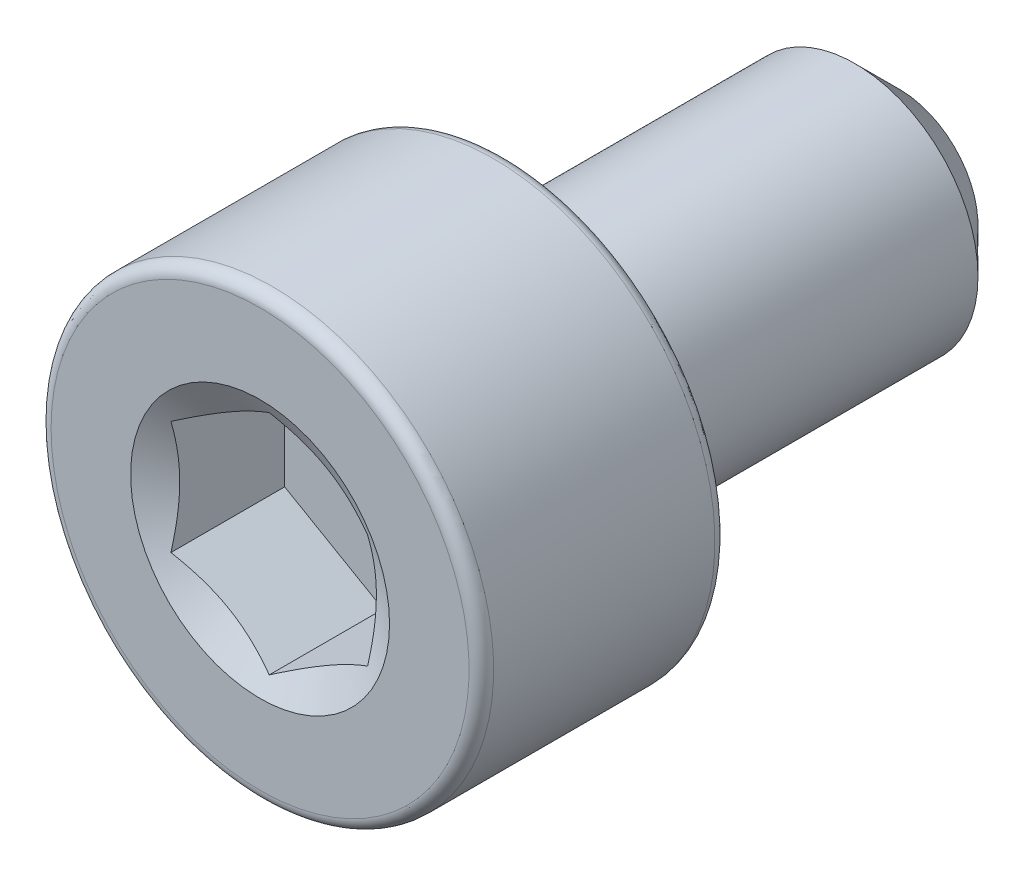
ISO-10303-21;
HEADER;
FILE_DESCRIPTION(('STEP AP214'),'2;1');
FILE_NAME('part.step','',(''),(''),'','','');
FILE_SCHEMA(('AUTOMOTIVE_DESIGN { 1 0 10303 214 1 1 1 1 }'));
ENDSEC;
DATA;
#1=APPLICATION_CONTEXT('core data for automotive mechanical design processes');
#2=APPLICATION_PROTOCOL_DEFINITION('international standard','automotive_design',2000,#1);
#3=PRODUCT_CONTEXT('',#1,'mechanical');
#4=PRODUCT('Part','Part','',(#3));
#5=PRODUCT_RELATED_PRODUCT_CATEGORY('part','',(#4));
#6=PRODUCT_DEFINITION_FORMATION('','',#4);
#7=PRODUCT_DEFINITION_CONTEXT('part definition',#1,'design');
#8=PRODUCT_DEFINITION('design','',#6,#7);
#9=PRODUCT_DEFINITION_SHAPE('','',#8);
#10=(LENGTH_UNIT() NAMED_UNIT(*) SI_UNIT(.MILLI.,.METRE.));
#11=(NAMED_UNIT(*) PLANE_ANGLE_UNIT() SI_UNIT($,.RADIAN.));
#12=(NAMED_UNIT(*) SI_UNIT($,.STERADIAN.) SOLID_ANGLE_UNIT());
#13=UNCERTAINTY_MEASURE_WITH_UNIT(LENGTH_MEASURE(1.E-05),#10,'distance_accuracy_value','');
#14=(GEOMETRIC_REPRESENTATION_CONTEXT(3) GLOBAL_UNCERTAINTY_ASSIGNED_CONTEXT((#13)) GLOBAL_UNIT_ASSIGNED_CONTEXT((#10,
#11,#12)) REPRESENTATION_CONTEXT('',''));
#15=CARTESIAN_POINT('',(0.,0.,0.));
#16=DIRECTION('',(0.,0.,1.));
#17=DIRECTION('',(1.,0.,0.));
#18=AXIS2_PLACEMENT_3D('',#15,#16,#17);
#19=CARTESIAN_POINT('',(0.,0.,-3.25));
#20=DIRECTION('',(0.,0.,-1.));
#21=DIRECTION('',(-1.,0.,0.));
#22=AXIS2_PLACEMENT_3D('',#19,#20,#21);
#23=PLANE('',#22);
#24=CARTESIAN_POINT('',(0.,0.,-3.25));
#25=DIRECTION('',(0.,0.,-1.));
#26=DIRECTION('',(-1.,0.,0.));
#27=AXIS2_PLACEMENT_3D('',#24,#25,#26);
#28=CIRCLE('',#27,0.800000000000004);
#29=CARTESIAN_POINT('',(-0.800000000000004,0.,-3.25));
#30=VERTEX_POINT('',#29);
#31=EDGE_CURVE('E54',#30,#30,#28,.T.);
#32=ORIENTED_EDGE('',*,*,#31,.T.);
#33=EDGE_LOOP('',(#32));
#34=FACE_BOUND('',#33,.T.);
#35=ADVANCED_FACE('F41',(#34),#23,.T.);
#36=CARTESIAN_POINT('',(0.,0.,-3.25));
#37=DIRECTION('',(0.,0.,1.));
#38=DIRECTION('',(1.,0.,0.));
#39=AXIS2_PLACEMENT_3D('',#36,#37,#38);
#40=CONICAL_SURFACE('',#39,0.800000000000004,0.78539816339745);
#41=CARTESIAN_POINT('',(0.,0.,-2.8));
#42=DIRECTION('',(0.,0.,-1.));
#43=DIRECTION('',(-1.,0.,0.));
#44=AXIS2_PLACEMENT_3D('',#41,#42,#43);
#45=CIRCLE('',#44,1.25);
#46=CARTESIAN_POINT('',(-1.25,0.,-2.8));
#47=VERTEX_POINT('',#46);
#48=EDGE_CURVE('E139',#47,#47,#45,.T.);
#49=ORIENTED_EDGE('',*,*,#48,.T.);
#50=EDGE_LOOP('',(#49));
#51=FACE_BOUND('',#50,.T.);
#52=ORIENTED_EDGE('',*,*,#31,.F.);
#53=EDGE_LOOP('',(#52));
#54=FACE_BOUND('',#53,.T.);
#55=ADVANCED_FACE('F145',(#51,#54),#40,.T.);
#56=CARTESIAN_POINT('',(0.,0.,-3.25));
#57=DIRECTION('',(0.,0.,-1.));
#58=DIRECTION('',(-1.,0.,0.));
#59=AXIS2_PLACEMENT_3D('',#56,#57,#58);
#60=CYLINDRICAL_SURFACE('',#59,1.25);
#61=CARTESIAN_POINT('',(0.,0.,0.75));
#62=DIRECTION('',(0.,0.,-1.));
#63=DIRECTION('',(-1.,0.,0.));
#64=AXIS2_PLACEMENT_3D('',#61,#62,#63);
#65=CIRCLE('',#64,1.25);
#66=CARTESIAN_POINT('',(-1.25,0.,0.75));
#67=VERTEX_POINT('',#66);
#68=EDGE_CURVE('E136',#67,#67,#65,.T.);
#69=ORIENTED_EDGE('',*,*,#68,.T.);
#70=EDGE_LOOP('',(#69));
#71=FACE_BOUND('',#70,.T.);
#72=ORIENTED_EDGE('',*,*,#48,.F.);
#73=EDGE_LOOP('',(#72));
#74=FACE_BOUND('',#73,.T.);
#75=ADVANCED_FACE('F147',(#71,#74),#60,.T.);
#76=CARTESIAN_POINT('',(0.,1.25,0.750000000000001));
#77=DIRECTION('',(0.,0.,-1.));
#78=DIRECTION('',(-1.,0.,0.));
#79=AXIS2_PLACEMENT_3D('',#76,#77,#78);
#80=PLANE('',#79);
#81=CARTESIAN_POINT('',(0.,0.,0.750000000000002));
#82=DIRECTION('',(0.,0.,-1.));
#83=DIRECTION('',(-1.,0.,0.));
#84=AXIS2_PLACEMENT_3D('',#81,#82,#83);
#85=CIRCLE('',#84,2.125);
#86=CARTESIAN_POINT('',(-2.125,0.,0.750000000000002));
#87=VERTEX_POINT('',#86);
#88=EDGE_CURVE('E133',#87,#87,#85,.T.);
#89=ORIENTED_EDGE('',*,*,#88,.T.);
#90=EDGE_LOOP('',(#89));
#91=FACE_BOUND('',#90,.T.);
#92=ORIENTED_EDGE('',*,*,#68,.F.);
#93=EDGE_LOOP('',(#92));
#94=FACE_BOUND('',#93,.T.);
#95=ADVANCED_FACE('F153',(#91,#94),#80,.T.);
#96=CARTESIAN_POINT('',(0.,0.,0.875000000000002));
#97=DIRECTION('',(0.,0.,-1.));
#98=DIRECTION('',(-1.,0.,0.));
#99=AXIS2_PLACEMENT_3D('',#96,#97,#98);
#100=TOROIDAL_SURFACE('',#99,2.125,0.125);
#101=CARTESIAN_POINT('',(0.,0.,0.875000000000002));
#102=DIRECTION('',(0.,0.,-1.));
#103=DIRECTION('',(-1.,0.,0.));
#104=AXIS2_PLACEMENT_3D('',#101,#102,#103);
#105=CIRCLE('',#104,2.25);
#106=CARTESIAN_POINT('',(-2.25,0.,0.875000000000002));
#107=VERTEX_POINT('',#106);
#108=EDGE_CURVE('E130',#107,#107,#105,.T.);
#109=ORIENTED_EDGE('',*,*,#108,.T.);
#110=EDGE_LOOP('',(#109));
#111=FACE_BOUND('',#110,.T.);
#112=ORIENTED_EDGE('',*,*,#88,.F.);
#113=EDGE_LOOP('',(#112));
#114=FACE_BOUND('',#113,.T.);
#115=ADVANCED_FACE('F159',(#111,#114),#100,.T.);
#116=CARTESIAN_POINT('',(0.,0.,-3.25));
#117=DIRECTION('',(0.,0.,-1.));
#118=DIRECTION('',(-1.,0.,0.));
#119=AXIS2_PLACEMENT_3D('',#116,#117,#118);
#120=CYLINDRICAL_SURFACE('',#119,2.25);
#121=CARTESIAN_POINT('',(0.,0.,3.125));
#122=DIRECTION('',(0.,0.,-1.));
#123=DIRECTION('',(-1.,0.,0.));
#124=AXIS2_PLACEMENT_3D('',#121,#122,#123);
#125=CIRCLE('',#124,2.25);
#126=CARTESIAN_POINT('',(-2.25,0.,3.125));
#127=VERTEX_POINT('',#126);
#128=EDGE_CURVE('E127',#127,#127,#125,.T.);
#129=ORIENTED_EDGE('',*,*,#128,.T.);
#130=EDGE_LOOP('',(#129));
#131=FACE_BOUND('',#130,.T.);
#132=ORIENTED_EDGE('',*,*,#108,.F.);
#133=EDGE_LOOP('',(#132));
#134=FACE_BOUND('',#133,.T.);
#135=ADVANCED_FACE('F163',(#131,#134),#120,.T.);
#136=CARTESIAN_POINT('',(0.,0.,3.125));
#137=DIRECTION('',(0.,0.,-1.));
#138=DIRECTION('',(-1.,0.,0.));
#139=AXIS2_PLACEMENT_3D('',#136,#137,#138);
#140=TOROIDAL_SURFACE('',#139,2.125,0.125);
#141=CARTESIAN_POINT('',(0.,0.,3.25));
#142=DIRECTION('',(0.,0.,-1.));
#143=DIRECTION('',(-1.,0.,0.));
#144=AXIS2_PLACEMENT_3D('',#141,#142,#143);
#145=CIRCLE('',#144,2.125);
#146=CARTESIAN_POINT('',(-2.125,0.,3.25));
#147=VERTEX_POINT('',#146);
#148=EDGE_CURVE('E124',#147,#147,#145,.T.);
#149=ORIENTED_EDGE('',*,*,#148,.T.);
#150=EDGE_LOOP('',(#149));
#151=FACE_BOUND('',#150,.T.);
#152=ORIENTED_EDGE('',*,*,#128,.F.);
#153=EDGE_LOOP('',(#152));
#154=FACE_BOUND('',#153,.T.);
#155=ADVANCED_FACE('F167',(#151,#154),#140,.T.);
#156=CARTESIAN_POINT('',(0.,2.125,3.25));
#157=DIRECTION('',(0.,0.,1.));
#158=DIRECTION('',(1.,0.,0.));
#159=AXIS2_PLACEMENT_3D('',#156,#157,#158);
#160=PLANE('',#159);
#161=CARTESIAN_POINT('',(0.,0.,3.25));
#162=DIRECTION('',(0.,0.,1.));
#163=DIRECTION('',(1.,0.,0.));
#164=AXIS2_PLACEMENT_3D('',#161,#162,#163);
#165=CIRCLE('',#164,1.31641711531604);
#166=CARTESIAN_POINT('',(1.31641711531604,0.,3.25));
#167=VERTEX_POINT('',#166);
#168=EDGE_CURVE('E261',#167,#167,#165,.T.);
#169=ORIENTED_EDGE('',*,*,#168,.F.);
#170=EDGE_LOOP('',(#169));
#171=FACE_BOUND('',#170,.T.);
#172=ORIENTED_EDGE('',*,*,#148,.F.);
#173=EDGE_LOOP('',(#172));
#174=FACE_BOUND('',#173,.T.);
#175=ADVANCED_FACE('F171',(#171,#174),#160,.T.);
#176=CARTESIAN_POINT('',(0.,0.,3.25));
#177=DIRECTION('',(0.,0.,1.));
#178=DIRECTION('',(1.,0.,0.));
#179=AXIS2_PLACEMENT_3D('',#176,#177,#178);
#180=CONICAL_SURFACE('',#179,1.31641711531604,1.0471975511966);
#181=ORIENTED_EDGE('',*,*,#168,.T.);
#182=EDGE_LOOP('',(#181));
#183=FACE_BOUND('',#182,.T.);
#184=CARTESIAN_POINT('',(1.0002,0.577234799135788,3.15669956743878));
#185=CARTESIAN_POINT('',(0.956252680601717,0.602607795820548,3.14204186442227));
#186=CARTESIAN_POINT('',(0.911926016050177,0.628199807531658,3.12871061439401));
#187=CARTESIAN_POINT('',(0.822504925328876,0.679827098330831,3.10543939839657));
#188=CARTESIAN_POINT('',(0.777408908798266,0.705863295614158,3.0955076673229));
#189=CARTESIAN_POINT('',(0.687775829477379,0.757612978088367,3.0800455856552));
#190=CARTESIAN_POINT('',(0.643252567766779,0.783318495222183,3.07441235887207));
#191=CARTESIAN_POINT('',(0.553996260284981,0.834850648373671,3.06768417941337));
#192=CARTESIAN_POINT('',(0.509263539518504,0.860677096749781,3.06658365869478));
#193=CARTESIAN_POINT('',(0.425658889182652,0.908946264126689,3.06885794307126));
#194=CARTESIAN_POINT('',(0.386774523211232,0.931396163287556,3.07167432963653));
#195=CARTESIAN_POINT('',(0.309259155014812,0.976149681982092,3.08060534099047));
#196=CARTESIAN_POINT('',(0.270628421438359,0.99845314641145,3.08672302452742));
#197=CARTESIAN_POINT('',(0.192952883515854,1.04329913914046,3.10201861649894));
#198=CARTESIAN_POINT('',(0.153917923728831,1.0658359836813,3.11126144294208));
#199=CARTESIAN_POINT('',(0.0764306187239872,1.11057330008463,3.13223973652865));
#200=CARTESIAN_POINT('',(0.0379772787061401,1.13277434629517,3.14397026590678));
#201=CARTESIAN_POINT('',(-0.000200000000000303,1.15481600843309,3.15669956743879));
#202=B_SPLINE_CURVE_WITH_KNOTS('',3,(#184,#185,#186,#187,#188,#189,#190,#191,#192,#193,#194,
#195,#196,#197,#198,#199,#200,#201),.UNSPECIFIED.,.F.,.F.,(4,2,2,2,2,2,2,2,4),(0.,
0.158523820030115,0.317428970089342,0.472400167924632,0.627180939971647,0.762016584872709,
0.896977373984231,1.03493410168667,1.17261952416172),.UNSPECIFIED.);
#203=CARTESIAN_POINT('',(0.999999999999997,0.577350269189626,3.15663289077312));
#204=VERTEX_POINT('',#203);
#205=CARTESIAN_POINT('',(0.,1.15470053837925,3.15663289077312));
#206=VERTEX_POINT('',#205);
#207=EDGE_CURVE('E108',#204,#206,#202,.T.);
#208=ORIENTED_EDGE('',*,*,#207,.F.);
#209=CARTESIAN_POINT('',(0.999999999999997,-1.51684483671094,3.53890509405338));
#210=CARTESIAN_POINT('',(0.999999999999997,-1.47342426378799,3.51797905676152));
#211=CARTESIAN_POINT('',(0.999999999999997,-1.42990080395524,3.49726747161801));
#212=CARTESIAN_POINT('',(0.999999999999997,-1.34259179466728,3.4563852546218));
#213=CARTESIAN_POINT('',(0.999999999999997,-1.29880620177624,3.43621471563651));
#214=CARTESIAN_POINT('',(0.999999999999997,-1.16648629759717,3.37646417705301));
#215=CARTESIAN_POINT('',(0.999999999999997,-1.07748950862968,3.33788980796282));
#216=CARTESIAN_POINT('',(0.999999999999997,-0.895228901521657,3.26393589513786));
#217=CARTESIAN_POINT('',(0.999999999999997,-0.801915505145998,3.22867696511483));
#218=CARTESIAN_POINT('',(0.999999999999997,-0.612894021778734,3.16566771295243));
#219=CARTESIAN_POINT('',(0.999999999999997,-0.517192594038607,3.13789861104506));
#220=CARTESIAN_POINT('',(0.999999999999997,-0.371801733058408,3.10539727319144));
#221=CARTESIAN_POINT('',(0.999999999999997,-0.323145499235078,3.09609981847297));
#222=CARTESIAN_POINT('',(0.999999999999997,-0.225264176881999,3.08115647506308));
#223=CARTESIAN_POINT('',(0.999999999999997,-0.176039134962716,3.07551028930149));
#224=CARTESIAN_POINT('',(0.999999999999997,-0.0778942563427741,3.06839261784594));
#225=CARTESIAN_POINT('',(0.999999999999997,-0.028978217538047,3.06687017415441));
#226=CARTESIAN_POINT('',(0.999999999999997,0.0688048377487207,3.06799173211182));
#227=CARTESIAN_POINT('',(0.999999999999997,0.117671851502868,3.07063595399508));
#228=CARTESIAN_POINT('',(0.999999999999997,0.23696275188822,3.08194387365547));
#229=CARTESIAN_POINT('',(0.999999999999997,0.30718074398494,3.09278265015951));
#230=CARTESIAN_POINT('',(0.999999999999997,0.446288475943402,3.12107521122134));
#231=CARTESIAN_POINT('',(0.999999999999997,0.515176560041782,3.13853674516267));
#232=CARTESIAN_POINT('',(0.999999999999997,0.61822409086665,3.16851810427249));
#233=CARTESIAN_POINT('',(0.999999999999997,0.652913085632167,3.17928638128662));
#234=CARTESIAN_POINT('',(0.999999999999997,0.721929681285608,3.20185895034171));
#235=CARTESIAN_POINT('',(0.999999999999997,0.756257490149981,3.2136626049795));
#236=CARTESIAN_POINT('',(0.999999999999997,0.858768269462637,3.25036151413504));
#237=CARTESIAN_POINT('',(0.999999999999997,0.926487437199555,3.27654738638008));
#238=CARTESIAN_POINT('',(0.999999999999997,1.10273977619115,3.34826112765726));
#239=CARTESIAN_POINT('',(0.999999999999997,1.21048536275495,3.39569661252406));
#240=CARTESIAN_POINT('',(0.999999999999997,1.42436916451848,3.49407513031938));
#241=CARTESIAN_POINT('',(0.999999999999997,1.53050688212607,3.54501922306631));
#242=CARTESIAN_POINT('',(0.999999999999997,1.74185602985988,3.64913686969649));
#243=CARTESIAN_POINT('',(0.999999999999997,1.8470660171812,3.70231333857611));
#244=CARTESIAN_POINT('',(0.999999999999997,2.05674691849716,3.81005900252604));
#245=CARTESIAN_POINT('',(0.999999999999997,2.16121793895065,3.86462799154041));
#246=CARTESIAN_POINT('',(0.999999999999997,2.35935199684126,3.96928027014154));
#247=CARTESIAN_POINT('',(0.999999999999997,2.45306257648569,4.01927375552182));
#248=CARTESIAN_POINT('',(0.999999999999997,2.64018136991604,4.11983231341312));
#249=CARTESIAN_POINT('',(0.999999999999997,2.73358957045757,4.17039741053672));
#250=CARTESIAN_POINT('',(0.999999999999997,2.91991444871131,4.27181307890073));
#251=CARTESIAN_POINT('',(0.999999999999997,3.01283177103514,4.32266246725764));
#252=CARTESIAN_POINT('',(0.999999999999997,3.19847838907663,4.42469057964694));
#253=CARTESIAN_POINT('',(0.999999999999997,3.29120769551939,4.4758692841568));
#254=CARTESIAN_POINT('',(0.999999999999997,3.3838700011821,4.5271682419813));
#255=B_SPLINE_CURVE_WITH_KNOTS('',3,(#209,#210,#211,#212,#213,#214,#215,#216,#217,#218,#219,
#220,#221,#222,#223,#224,#225,#226,#227,#228,#229,#230,#231,#232,#233,#234,#235,#236,#237,#238,
#239,#240,#241,#242,#243,#244,#245,#246,#247,#248,#249,#250,#251,#252,#253,#254),.UNSPECIFIED.,
.F.,.F.,(4,2,2,2,2,2,2,2,2,2,2,2,2,2,2,2,2,2,2,2,2,2,4),(0.,0.144597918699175,0.289220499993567,
0.580136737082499,0.879248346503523,1.17760284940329,1.3260995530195,1.47458417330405,
1.62122538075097,1.76787433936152,1.98058665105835,2.19354863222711,2.30250175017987,
2.41138825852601,2.62913359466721,2.98218821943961,3.33534996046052,3.68898814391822,
4.04257429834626,4.36120821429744,4.67985590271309,4.9976186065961,5.31536264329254),.UNSPECIFIED.);
#256=CARTESIAN_POINT('',(0.999999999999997,-0.577350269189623,3.15663289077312));
#257=VERTEX_POINT('',#256);
#258=EDGE_CURVE('E217',#257,#204,#255,.T.);
#259=ORIENTED_EDGE('',*,*,#258,.F.);
#260=CARTESIAN_POINT('',(-0.000200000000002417,-1.15481600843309,3.15669956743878));
#261=CARTESIAN_POINT('',(0.0437473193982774,-1.12944301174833,3.14204186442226));
#262=CARTESIAN_POINT('',(0.0880739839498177,-1.10385100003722,3.12871061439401));
#263=CARTESIAN_POINT('',(0.177495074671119,-1.05222370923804,3.10543939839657));
#264=CARTESIAN_POINT('',(0.222591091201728,-1.02618751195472,3.0955076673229));
#265=CARTESIAN_POINT('',(0.312224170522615,-0.974437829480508,3.0800455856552));
#266=CARTESIAN_POINT('',(0.356747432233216,-0.948732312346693,3.07441235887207));
#267=CARTESIAN_POINT('',(0.446003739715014,-0.897200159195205,3.06768417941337));
#268=CARTESIAN_POINT('',(0.490736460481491,-0.871373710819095,3.06658365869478));
#269=CARTESIAN_POINT('',(0.574341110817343,-0.823104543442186,3.06885794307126));
#270=CARTESIAN_POINT('',(0.613225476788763,-0.800654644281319,3.07167432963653));
#271=CARTESIAN_POINT('',(0.690740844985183,-0.755901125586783,3.08060534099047));
#272=CARTESIAN_POINT('',(0.729371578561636,-0.733597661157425,3.08672302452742));
#273=CARTESIAN_POINT('',(0.807047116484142,-0.688751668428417,3.10201861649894));
#274=CARTESIAN_POINT('',(0.846082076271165,-0.666214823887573,3.11126144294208));
#275=CARTESIAN_POINT('',(0.923569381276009,-0.621477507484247,3.13223973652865));
#276=CARTESIAN_POINT('',(0.962022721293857,-0.599276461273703,3.14397026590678));
#277=CARTESIAN_POINT('',(1.0002,-0.577234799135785,3.15669956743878));
#278=B_SPLINE_CURVE_WITH_KNOTS('',3,(#260,#261,#262,#263,#264,#265,#266,#267,#268,#269,#270,
#271,#272,#273,#274,#275,#276,#277),.UNSPECIFIED.,.F.,.F.,(4,2,2,2,2,2,2,2,4),(0.,
0.158523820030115,0.317428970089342,0.472400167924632,0.627180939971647,0.76201658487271,
0.896977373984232,1.03493410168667,1.17261952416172),.UNSPECIFIED.);
#279=CARTESIAN_POINT('',(0.,-1.15470053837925,3.15663289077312));
#280=VERTEX_POINT('',#279);
#281=EDGE_CURVE('E211',#280,#257,#278,.T.);
#282=ORIENTED_EDGE('',*,*,#281,.F.);
#283=CARTESIAN_POINT('',(-1.0002,-0.577234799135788,3.15669956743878));
#284=CARTESIAN_POINT('',(-0.956252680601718,-0.602607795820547,3.14204186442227));
#285=CARTESIAN_POINT('',(-0.911926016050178,-0.628199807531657,3.12871061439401));
#286=CARTESIAN_POINT('',(-0.822504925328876,-0.67982709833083,3.10543939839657));
#287=CARTESIAN_POINT('',(-0.777408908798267,-0.705863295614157,3.0955076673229));
#288=CARTESIAN_POINT('',(-0.68777582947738,-0.757612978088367,3.0800455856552));
#289=CARTESIAN_POINT('',(-0.643252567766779,-0.783318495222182,3.07441235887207));
#290=CARTESIAN_POINT('',(-0.553996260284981,-0.83485064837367,3.06768417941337));
#291=CARTESIAN_POINT('',(-0.509263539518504,-0.86067709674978,3.06658365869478));
#292=CARTESIAN_POINT('',(-0.425658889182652,-0.908946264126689,3.06885794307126));
#293=CARTESIAN_POINT('',(-0.386774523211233,-0.931396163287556,3.07167432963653));
#294=CARTESIAN_POINT('',(-0.309259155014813,-0.976149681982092,3.08060534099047));
#295=CARTESIAN_POINT('',(-0.270628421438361,-0.998453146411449,3.08672302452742));
#296=CARTESIAN_POINT('',(-0.192952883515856,-1.04329913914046,3.10201861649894));
#297=CARTESIAN_POINT('',(-0.153917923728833,-1.0658359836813,3.11126144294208));
#298=CARTESIAN_POINT('',(-0.0764306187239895,-1.11057330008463,3.13223973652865));
#299=CARTESIAN_POINT('',(-0.0379772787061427,-1.13277434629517,3.14397026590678));
#300=CARTESIAN_POINT('',(0.000199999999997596,-1.15481600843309,3.15669956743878));
#301=B_SPLINE_CURVE_WITH_KNOTS('',3,(#283,#284,#285,#286,#287,#288,#289,#290,#291,#292,#293,
#294,#295,#296,#297,#298,#299,#300),.UNSPECIFIED.,.F.,.F.,(4,2,2,2,2,2,2,2,4),(0.,
0.158523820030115,0.317428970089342,0.472400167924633,0.627180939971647,0.762016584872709,
0.89697737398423,1.03493410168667,1.17261952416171),.UNSPECIFIED.);
#302=CARTESIAN_POINT('',(-0.999999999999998,-0.577350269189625,3.15663289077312));
#303=VERTEX_POINT('',#302);
#304=EDGE_CURVE('E61',#303,#280,#301,.T.);
#305=ORIENTED_EDGE('',*,*,#304,.F.);
#306=CARTESIAN_POINT('',(-0.999999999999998,-1.51684483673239,3.53890509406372));
#307=CARTESIAN_POINT('',(-0.999999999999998,-1.47342426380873,3.51797905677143));
#308=CARTESIAN_POINT('',(-0.999999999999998,-1.42990080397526,3.49726747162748));
#309=CARTESIAN_POINT('',(-0.999999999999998,-1.34259179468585,3.4563852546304));
#310=CARTESIAN_POINT('',(-0.999999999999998,-1.29880620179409,3.43621471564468));
#311=CARTESIAN_POINT('',(-0.999999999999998,-1.16648629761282,3.37646417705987));
#312=CARTESIAN_POINT('',(-0.999999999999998,-1.07748950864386,3.33788980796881));
#313=CARTESIAN_POINT('',(-0.999999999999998,-0.895228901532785,3.26393589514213));
#314=CARTESIAN_POINT('',(-0.999999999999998,-0.801915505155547,3.22867696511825));
#315=CARTESIAN_POINT('',(-0.999999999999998,-0.612894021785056,3.1656677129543));
#316=CARTESIAN_POINT('',(-0.999999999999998,-0.517192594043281,3.13789861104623));
#317=CARTESIAN_POINT('',(-0.999999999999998,-0.371801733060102,3.10539727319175));
#318=CARTESIAN_POINT('',(-0.999999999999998,-0.323145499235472,3.096099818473));
#319=CARTESIAN_POINT('',(-0.999999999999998,-0.225264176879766,3.08115647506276));
#320=CARTESIAN_POINT('',(-0.999999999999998,-0.176039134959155,3.0755102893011));
#321=CARTESIAN_POINT('',(-0.999999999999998,-0.0778942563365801,3.06839261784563));
#322=CARTESIAN_POINT('',(-0.999999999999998,-0.0289782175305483,3.06687017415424));
#323=CARTESIAN_POINT('',(-0.999999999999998,0.0688048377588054,3.06799173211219));
#324=CARTESIAN_POINT('',(-0.999999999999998,0.117671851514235,3.07063595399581));
#325=CARTESIAN_POINT('',(-0.999999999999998,0.236962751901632,3.08194387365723));
#326=CARTESIAN_POINT('',(-0.999999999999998,0.307180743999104,3.09278265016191));
#327=CARTESIAN_POINT('',(-0.999999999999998,0.446288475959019,3.12107521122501));
#328=CARTESIAN_POINT('',(-0.999999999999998,0.5151765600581,3.13853674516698));
#329=CARTESIAN_POINT('',(-0.999999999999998,0.618224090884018,3.16851810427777));
#330=CARTESIAN_POINT('',(-0.999999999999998,0.652913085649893,3.17928638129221));
#331=CARTESIAN_POINT('',(-0.999999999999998,0.721929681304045,3.20185895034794));
#332=CARTESIAN_POINT('',(-0.999999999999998,0.756257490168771,3.21366260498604));
#333=CARTESIAN_POINT('',(-0.999999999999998,0.858768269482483,3.25036151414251));
#334=CARTESIAN_POINT('',(-0.999999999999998,0.926487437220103,3.27654738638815));
#335=CARTESIAN_POINT('',(-0.999999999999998,1.10273977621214,3.34826112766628));
#336=CARTESIAN_POINT('',(-0.999999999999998,1.21048536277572,3.39569661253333));
#337=CARTESIAN_POINT('',(-0.999999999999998,1.42436916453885,3.49407513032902));
#338=CARTESIAN_POINT('',(-0.999999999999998,1.53050688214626,3.54501922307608));
#339=CARTESIAN_POINT('',(-0.999999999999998,1.74185602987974,3.64913686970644));
#340=CARTESIAN_POINT('',(-0.999999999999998,1.8470660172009,3.70231333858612));
#341=CARTESIAN_POINT('',(-0.999999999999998,2.05674691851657,3.81005900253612));
#342=CARTESIAN_POINT('',(-0.999999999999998,2.16121793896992,3.86462799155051));
#343=CARTESIAN_POINT('',(-0.999999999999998,2.35935199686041,3.96928027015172));
#344=CARTESIAN_POINT('',(-0.999999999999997,2.45306257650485,4.01927375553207));
#345=CARTESIAN_POINT('',(-0.999999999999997,2.64018136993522,4.11983231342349));
#346=CARTESIAN_POINT('',(-0.999999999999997,2.73358957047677,4.17039741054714));
#347=CARTESIAN_POINT('',(-0.999999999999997,2.91991444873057,4.27181307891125));
#348=CARTESIAN_POINT('',(-0.999999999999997,3.01283177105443,4.32266246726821));
#349=CARTESIAN_POINT('',(-0.999999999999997,3.198478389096,4.42469057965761));
#350=CARTESIAN_POINT('',(-0.999999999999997,3.2912076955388,4.47586928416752));
#351=CARTESIAN_POINT('',(-0.999999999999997,3.38387000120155,4.52716824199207));
#352=B_SPLINE_CURVE_WITH_KNOTS('',3,(#306,#307,#308,#309,#310,#311,#312,#313,#314,#315,#316,
#317,#318,#319,#320,#321,#322,#323,#324,#325,#326,#327,#328,#329,#330,#331,#332,#333,#334,#335,
#336,#337,#338,#339,#340,#341,#342,#343,#344,#345,#346,#347,#348,#349,#350,#351),.UNSPECIFIED.,
.F.,.F.,(4,2,2,2,2,2,2,2,2,2,2,2,2,2,2,2,2,2,2,2,2,2,4),(0.,0.144597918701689,0.289220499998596,
0.58013673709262,0.879248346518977,1.17760284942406,1.32609955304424,1.47458417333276,
1.62122538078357,1.767874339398,1.98058665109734,2.19354863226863,2.30250175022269,
2.41138825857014,2.62913359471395,2.98218821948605,3.33534996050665,3.68898814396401,
4.04257429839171,4.36120821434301,4.67985590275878,4.99761860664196,5.31536264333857),.UNSPECIFIED.);
#353=CARTESIAN_POINT('',(-0.999999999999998,0.577350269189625,3.15663289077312));
#354=VERTEX_POINT('',#353);
#355=EDGE_CURVE('E11',#354,#303,#352,.F.);
#356=ORIENTED_EDGE('',*,*,#355,.F.);
#357=CARTESIAN_POINT('',(0.000199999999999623,1.15481600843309,3.15669956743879));
#358=CARTESIAN_POINT('',(-0.0437473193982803,1.12944301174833,3.14204186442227));
#359=CARTESIAN_POINT('',(-0.0880739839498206,1.10385100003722,3.12871061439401));
#360=CARTESIAN_POINT('',(-0.177495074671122,1.05222370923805,3.10543939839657));
#361=CARTESIAN_POINT('',(-0.222591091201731,1.02618751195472,3.0955076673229));
#362=CARTESIAN_POINT('',(-0.312224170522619,0.974437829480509,3.0800455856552));
#363=CARTESIAN_POINT('',(-0.356747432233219,0.948732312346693,3.07441235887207));
#364=CARTESIAN_POINT('',(-0.446003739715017,0.897200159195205,3.06768417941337));
#365=CARTESIAN_POINT('',(-0.490736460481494,0.871373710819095,3.06658365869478));
#366=CARTESIAN_POINT('',(-0.574341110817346,0.823104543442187,3.06885794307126));
#367=CARTESIAN_POINT('',(-0.613225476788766,0.800654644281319,3.07167432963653));
#368=CARTESIAN_POINT('',(-0.690740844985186,0.755901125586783,3.08060534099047));
#369=CARTESIAN_POINT('',(-0.729371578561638,0.733597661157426,3.08672302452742));
#370=CARTESIAN_POINT('',(-0.807047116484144,0.688751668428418,3.10201861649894));
#371=CARTESIAN_POINT('',(-0.846082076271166,0.666214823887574,3.11126144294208));
#372=CARTESIAN_POINT('',(-0.92356938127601,0.621477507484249,3.13223973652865));
#373=CARTESIAN_POINT('',(-0.962022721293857,0.599276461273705,3.14397026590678));
#374=CARTESIAN_POINT('',(-1.0002,0.577234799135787,3.15669956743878));
#375=B_SPLINE_CURVE_WITH_KNOTS('',3,(#357,#358,#359,#360,#361,#362,#363,#364,#365,#366,#367,
#368,#369,#370,#371,#372,#373,#374),.UNSPECIFIED.,.F.,.F.,(4,2,2,2,2,2,2,2,4),(0.,
0.158523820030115,0.317428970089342,0.472400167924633,0.627180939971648,0.76201658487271,
0.896977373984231,1.03493410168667,1.17261952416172),.UNSPECIFIED.);
#376=EDGE_CURVE('E99',#206,#354,#375,.T.);
#377=ORIENTED_EDGE('',*,*,#376,.F.);
#378=EDGE_LOOP('',(#208,#259,#282,#305,#356,#377));
#379=FACE_BOUND('',#378,.T.);
#380=ADVANCED_FACE('F98',(#183,#379),#180,.F.);
#381=CARTESIAN_POINT('',(0.,0.,2.));
#382=DIRECTION('',(0.,0.,1.));
#383=DIRECTION('',(1.,0.,0.));
#384=AXIS2_PLACEMENT_3D('',#381,#382,#383);
#385=PLANE('',#384);
#386=DIRECTION('',(-0.866025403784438,-0.500000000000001,0.));
#387=VECTOR('',#386,1.);
#388=CARTESIAN_POINT('',(0.,1.15470053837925,2.));
#389=LINE('',#388,#387);
#390=CARTESIAN_POINT('',(0.,1.15470053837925,2.));
#391=VERTEX_POINT('',#390);
#392=CARTESIAN_POINT('',(-0.999999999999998,0.577350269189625,2.));
#393=VERTEX_POINT('',#392);
#394=EDGE_CURVE('E107',#391,#393,#389,.T.);
#395=ORIENTED_EDGE('',*,*,#394,.T.);
#396=DIRECTION('',(0.,-1.,0.));
#397=VECTOR('',#396,1.);
#398=CARTESIAN_POINT('',(-0.999999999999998,0.577350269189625,2.));
#399=LINE('',#398,#397);
#400=CARTESIAN_POINT('',(-0.999999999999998,-0.577350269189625,2.));
#401=VERTEX_POINT('',#400);
#402=EDGE_CURVE('E112',#393,#401,#399,.T.);
#403=ORIENTED_EDGE('',*,*,#402,.T.);
#404=DIRECTION('',(0.866025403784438,-0.5,0.));
#405=VECTOR('',#404,1.);
#406=CARTESIAN_POINT('',(-0.999999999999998,-0.577350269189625,2.));
#407=LINE('',#406,#405);
#408=CARTESIAN_POINT('',(0.,-1.15470053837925,2.));
#409=VERTEX_POINT('',#408);
#410=EDGE_CURVE('E243',#401,#409,#407,.T.);
#411=ORIENTED_EDGE('',*,*,#410,.T.);
#412=DIRECTION('',(0.866025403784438,0.5,0.));
#413=VECTOR('',#412,1.);
#414=CARTESIAN_POINT('',(0.,-1.15470053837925,2.));
#415=LINE('',#414,#413);
#416=CARTESIAN_POINT('',(0.999999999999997,-0.577350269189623,2.));
#417=VERTEX_POINT('',#416);
#418=EDGE_CURVE('E247',#409,#417,#415,.T.);
#419=ORIENTED_EDGE('',*,*,#418,.T.);
#420=DIRECTION('',(0.,1.,0.));
#421=VECTOR('',#420,1.);
#422=CARTESIAN_POINT('',(0.999999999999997,-0.577350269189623,2.));
#423=LINE('',#422,#421);
#424=CARTESIAN_POINT('',(0.999999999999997,0.577350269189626,2.));
#425=VERTEX_POINT('',#424);
#426=EDGE_CURVE('E120',#417,#425,#423,.T.);
#427=ORIENTED_EDGE('',*,*,#426,.T.);
#428=DIRECTION('',(-0.866025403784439,0.5,0.));
#429=VECTOR('',#428,1.);
#430=CARTESIAN_POINT('',(0.999999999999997,0.577350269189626,2.));
#431=LINE('',#430,#429);
#432=EDGE_CURVE('E115',#425,#391,#431,.T.);
#433=ORIENTED_EDGE('',*,*,#432,.T.);
#434=EDGE_LOOP('',(#395,#403,#411,#419,#427,#433));
#435=FACE_BOUND('',#434,.T.);
#436=ADVANCED_FACE('F197',(#435),#385,.T.);
#437=CARTESIAN_POINT('',(-0.999999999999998,0.577350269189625,2.));
#438=DIRECTION('',(-1.,0.,0.));
#439=DIRECTION('',(0.,-1.,0.));
#440=AXIS2_PLACEMENT_3D('',#437,#438,#439);
#441=PLANE('',#440);
#442=DIRECTION('',(0.,0.,1.));
#443=VECTOR('',#442,1.);
#444=CARTESIAN_POINT('',(-0.999999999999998,0.577350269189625,2.));
#445=LINE('',#444,#443);
#446=EDGE_CURVE('E105',#393,#354,#445,.T.);
#447=ORIENTED_EDGE('',*,*,#446,.T.);
#448=ORIENTED_EDGE('',*,*,#355,.T.);
#449=DIRECTION('',(0.,0.,1.));
#450=VECTOR('',#449,1.);
#451=CARTESIAN_POINT('',(-0.999999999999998,-0.577350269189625,2.));
#452=LINE('',#451,#450);
#453=EDGE_CURVE('E114',#401,#303,#452,.T.);
#454=ORIENTED_EDGE('',*,*,#453,.F.);
#455=ORIENTED_EDGE('',*,*,#402,.F.);
#456=EDGE_LOOP('',(#447,#448,#454,#455));
#457=FACE_BOUND('',#456,.T.);
#458=ADVANCED_FACE('F110',(#457),#441,.F.);
#459=CARTESIAN_POINT('',(-0.999999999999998,-0.577350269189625,2.));
#460=DIRECTION('',(-0.5,-0.866025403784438,0.));
#461=DIRECTION('',(0.866025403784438,-0.5,0.));
#462=AXIS2_PLACEMENT_3D('',#459,#460,#461);
#463=PLANE('',#462);
#464=ORIENTED_EDGE('',*,*,#453,.T.);
#465=ORIENTED_EDGE('',*,*,#304,.T.);
#466=DIRECTION('',(0.,0.,1.));
#467=VECTOR('',#466,1.);
#468=CARTESIAN_POINT('',(0.,-1.15470053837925,2.));
#469=LINE('',#468,#467);
#470=EDGE_CURVE('E117',#409,#280,#469,.T.);
#471=ORIENTED_EDGE('',*,*,#470,.F.);
#472=ORIENTED_EDGE('',*,*,#410,.F.);
#473=EDGE_LOOP('',(#464,#465,#471,#472));
#474=FACE_BOUND('',#473,.T.);
#475=ADVANCED_FACE('F232',(#474),#463,.F.);
#476=CARTESIAN_POINT('',(0.,-1.15470053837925,2.));
#477=DIRECTION('',(0.5,-0.866025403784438,0.));
#478=DIRECTION('',(0.866025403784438,0.5,0.));
#479=AXIS2_PLACEMENT_3D('',#476,#477,#478);
#480=PLANE('',#479);
#481=ORIENTED_EDGE('',*,*,#470,.T.);
#482=ORIENTED_EDGE('',*,*,#281,.T.);
#483=DIRECTION('',(0.,0.,1.));
#484=VECTOR('',#483,1.);
#485=CARTESIAN_POINT('',(0.999999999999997,-0.577350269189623,2.));
#486=LINE('',#485,#484);
#487=EDGE_CURVE('E257',#417,#257,#486,.T.);
#488=ORIENTED_EDGE('',*,*,#487,.F.);
#489=ORIENTED_EDGE('',*,*,#418,.F.);
#490=EDGE_LOOP('',(#481,#482,#488,#489));
#491=FACE_BOUND('',#490,.T.);
#492=ADVANCED_FACE('F227',(#491),#480,.F.);
#493=CARTESIAN_POINT('',(0.999999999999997,-0.577350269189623,2.));
#494=DIRECTION('',(1.,0.,0.));
#495=DIRECTION('',(0.,0.,-1.));
#496=AXIS2_PLACEMENT_3D('',#493,#494,#495);
#497=PLANE('',#496);
#498=ORIENTED_EDGE('',*,*,#487,.T.);
#499=ORIENTED_EDGE('',*,*,#258,.T.);
#500=DIRECTION('',(0.,0.,1.));
#501=VECTOR('',#500,1.);
#502=CARTESIAN_POINT('',(0.999999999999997,0.577350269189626,2.));
#503=LINE('',#502,#501);
#504=EDGE_CURVE('E254',#425,#204,#503,.T.);
#505=ORIENTED_EDGE('',*,*,#504,.F.);
#506=ORIENTED_EDGE('',*,*,#426,.F.);
#507=EDGE_LOOP('',(#498,#499,#505,#506));
#508=FACE_BOUND('',#507,.T.);
#509=ADVANCED_FACE('F224',(#508),#497,.F.);
#510=CARTESIAN_POINT('',(0.999999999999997,0.577350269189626,2.));
#511=DIRECTION('',(0.5,0.866025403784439,0.));
#512=DIRECTION('',(-0.866025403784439,0.5,0.));
#513=AXIS2_PLACEMENT_3D('',#510,#511,#512);
#514=PLANE('',#513);
#515=ORIENTED_EDGE('',*,*,#504,.T.);
#516=ORIENTED_EDGE('',*,*,#207,.T.);
#517=DIRECTION('',(0.,0.,1.));
#518=VECTOR('',#517,1.);
#519=CARTESIAN_POINT('',(0.,1.15470053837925,2.));
#520=LINE('',#519,#518);
#521=EDGE_CURVE('E68',#391,#206,#520,.T.);
#522=ORIENTED_EDGE('',*,*,#521,.F.);
#523=ORIENTED_EDGE('',*,*,#432,.F.);
#524=EDGE_LOOP('',(#515,#516,#522,#523));
#525=FACE_BOUND('',#524,.T.);
#526=ADVANCED_FACE('F178',(#525),#514,.F.);
#527=CARTESIAN_POINT('',(0.,1.15470053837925,2.));
#528=DIRECTION('',(-0.500000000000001,0.866025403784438,0.));
#529=DIRECTION('',(-0.866025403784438,-0.500000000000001,0.));
#530=AXIS2_PLACEMENT_3D('',#527,#528,#529);
#531=PLANE('',#530);
#532=ORIENTED_EDGE('',*,*,#521,.T.);
#533=ORIENTED_EDGE('',*,*,#376,.T.);
#534=ORIENTED_EDGE('',*,*,#446,.F.);
#535=ORIENTED_EDGE('',*,*,#394,.F.);
#536=EDGE_LOOP('',(#532,#533,#534,#535));
#537=FACE_BOUND('',#536,.T.);
#538=ADVANCED_FACE('F104',(#537),#531,.F.);
#539=CLOSED_SHELL('',(#35,#55,#75,#95,#115,#135,#155,#175,#380,#436,#458,#475,#492,#509,#526,#538));
#540=MANIFOLD_SOLID_BREP('B2',#539);
#541=ADVANCED_BREP_SHAPE_REPRESENTATION('',(#18,#540),#14);
#542=SHAPE_DEFINITION_REPRESENTATION(#9,#541);
ENDSEC;
END-ISO-10303-21;
